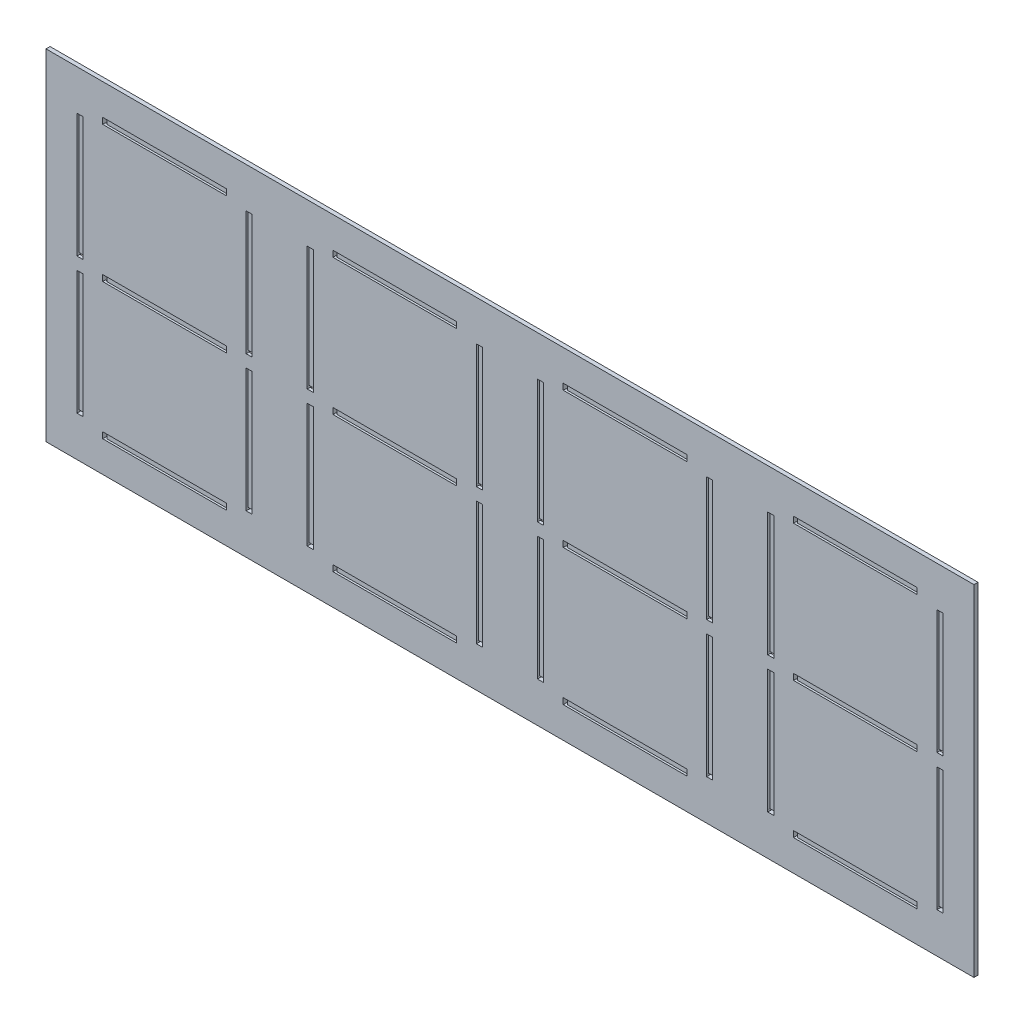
from build123d import *

# Parameters (mm, degrees)
SKETCH2_W           = 2286
SKETCH2_H           = 838.2
BOSS_EXTRUDE1_DEPTH = 10
SKETCH4_W           = 304.8
SKETCH4_H           = 15
SKETCH4_W_2         = 15
SKETCH4_H_2         = 304.8
CUT_EXTRUDE1_DEPTH  = 5
LPATTERN1_COUNT     = 4
LPATTERN1_PITCH     = 567.266666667
SKETCH4_4_W         = 304.8
SKETCH4_4_H         = 15
SKETCH4_4_W_2       = 15
SKETCH4_4_H_2       = 304.8
CUT_EXTRUDE2_DEPTH  = 5
LPATTERN2_COUNT     = 4
LPATTERN2_PITCH     = 567.266582
CUT_EXTRUDE3_START  = -205.994
SKETCH5_W           = 15
SKETCH5_H           = 5
SKETCH5_W_2         = 5
SKETCH5_H_2         = 15
CUT_EXTRUDE3_DEPTH  = 466.598
LPATTERN4_COUNT     = 4
LPATTERN4_PITCH     = 567.266582
CUT_EXTRUDE6_DEPTH  = 3


with BuildPart() as part:
    # Sketch2 → Boss-Extrude1 (new body)
    with BuildSketch(Plane.XY):
        Rectangle(SKETCH2_W, SKETCH2_H)
    extrude(amount=-BOSS_EXTRUDE1_DEPTH)

    # Sketch4 → Cut-Extrude1 (cut)
    with BuildSketch(Plane.XY):
        with Locations((-850.9, 335.4)):
            Rectangle(SKETCH4_W, SKETCH4_H)
        with Locations((-1059.3, 167.64)):
            Rectangle(SKETCH4_W_2, SKETCH4_H_2)
        with Locations((-642.5, 167.64)):
            Rectangle(SKETCH4_W_2, SKETCH4_H_2)
        with Locations((-642.5, -167.64)):
            Rectangle(SKETCH4_W_2, SKETCH4_H_2)
        with Locations((-850.9, -335.4)):
            Rectangle(SKETCH4_W, SKETCH4_H)
        with Locations((-1059.3, -167.64)):
            Rectangle(SKETCH4_W_2, SKETCH4_H_2)
    cut_extrude1 = extrude(amount=-CUT_EXTRUDE1_DEPTH, mode=Mode.SUBTRACT)

    # LPattern1: Cut-Extrude1 ×4
    with Locations(*[(i * LPATTERN1_PITCH, 0, 0) for i in range(1, LPATTERN1_COUNT)]):
        add(cut_extrude1, mode=Mode.SUBTRACT)

    # Sketch4_4 → Cut-Extrude2 (cut)
    with BuildSketch(Plane.XY):
        with Locations((-850.9, 335.4)):
            Rectangle(SKETCH4_4_W, SKETCH4_4_H)
        with Locations((-642.5, -167.64)):
            Rectangle(SKETCH4_4_W_2, SKETCH4_4_H_2)
        with Locations((-1059.3, 167.64)):
            Rectangle(SKETCH4_4_W_2, SKETCH4_4_H_2)
        with Locations((-642.5, 167.64)):
            Rectangle(SKETCH4_4_W_2, SKETCH4_4_H_2)
        with Locations((-1059.3, -167.64)):
            Rectangle(SKETCH4_4_W_2, SKETCH4_4_H_2)
        with Locations((-850.9, -335.4)):
            Rectangle(SKETCH4_4_W, SKETCH4_4_H)
        with Locations((-850.9, 0)):
            Rectangle(SKETCH4_4_W, SKETCH4_4_H)
    cut_extrude2 = extrude(amount=-CUT_EXTRUDE2_DEPTH, mode=Mode.SUBTRACT)

    # LPattern2: Cut-Extrude2 ×4
    with Locations(*[(i * LPATTERN2_PITCH, 0, 0) for i in range(1, LPATTERN2_COUNT)]):
        add(cut_extrude2, mode=Mode.SUBTRACT)

    # Sketch5 → Cut-Extrude3 (cut)
    with BuildSketch(Plane.XY.offset(CUT_EXTRUDE3_START)):
        with Locations((-1059.3, 17.74)):
            Rectangle(SKETCH5_W, SKETCH5_H)
        with Locations((-1000.8, 335.4)):
            Rectangle(SKETCH5_W_2, SKETCH5_H_2)
        with Locations((-642.5, 17.74)):
            Rectangle(SKETCH5_W, SKETCH5_H)
        with Locations((-642.5, -317.54)):
            Rectangle(SKETCH5_W, SKETCH5_H)
        with Locations((-1000.8, -335.4)):
            Rectangle(SKETCH5_W_2, SKETCH5_H_2)
        with Locations((-1059.3, -317.54)):
            Rectangle(SKETCH5_W, SKETCH5_H)
        with Locations((-1000.8, 0)):
            Rectangle(SKETCH5_W_2, SKETCH5_H_2)
    cut_extrude3 = extrude(amount=CUT_EXTRUDE3_DEPTH, mode=Mode.SUBTRACT)

    # LPattern4: Cut-Extrude3 ×4
    with Locations(*[(i * LPATTERN4_PITCH, 0, 0) for i in range(1, LPATTERN4_COUNT)]):
        add(cut_extrude3, mode=Mode.SUBTRACT)

    # Sketch6 → Cut-Extrude6 (cut)
    with BuildSketch(Plane(origin=(0, 0, -10), x_dir=(-1, 0, 0), z_dir=(0, 0, -1))):
        Polygon((-1051.799746, 15.24), (-1066.799746, 15.24), (-1066.799746, -315.04), (-1051.799746, -315.04), (-1051.799746, -226.1), (-713.499746, -226.1), (-713.499746, -342.619381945), (-698.499746, -342.619381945), (-698.499746, -226.1), (-649.999746, -226.1), (-649.999746, -315.04), (-634.999746, -315.04), (-634.999746, -226.1), (-499.533164, -226.1), (-499.533164, -315.04), (-484.533164, -315.04), (-484.533164, -226.1), (-146.233164, -226.1), (-146.233164, -342.865106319), (-131.233164, -342.865106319), (-131.233164, -226.1), (-82.733164, -226.1), (-82.733164, -315.04), (-67.733164, -315.04), (-67.733164, -226.1), (67.733418, -226.1), (67.733418, -315.04), (82.733418, -315.04), (82.733418, -226.1), (421.033418, -226.1), (421.033418, -342.9), (436.033418, -342.9), (436.033418, -226.1), (484.533418, -226.1), (484.533418, -315.04), (499.533418, -315.04), (499.533418, -226.1), (635, -226.1), (635, -315.04), (650, -315.04), (650, -226.1), (988.3, -226.1), (988.3, -342.9), (1003.3, -342.9), (1003.3, -226.1), (1051.8, -226.1), (1051.8, -315.04), (1066.8, -315.04), (1066.8, 15.24), (1051.8, 15.24), (1051.8, -149.9), (1003.3, -149.9), (1003.3, 342.9), (988.3, 342.9), (988.3, -149.9), (650, -149.9), (650, 15.24), (635, 15.24), (635, -149.9), (499.533418, -149.9), (499.533418, 15.24), (484.533418, 15.24), (484.533418, -149.9), (436.033418, -149.9), (436.033418, 342.9), (421.033418, 342.9), (421.033418, -149.9), (82.733418, -149.9), (82.733418, 15.24), (67.733418, 15.24), (67.733418, -149.9), (-67.733164, -149.9), (-67.733164, 15.24), (-82.733164, 15.24), (-82.733164, -149.9), (-131.233164, -149.9), (-131.233164, 342.9), (-146.233164, 342.9), (-146.233164, -149.9), (-484.533164, -149.9), (-484.533164, 15.24), (-499.533164, 15.24), (-499.533164, -149.9), (-634.999746, -149.9), (-634.999746, 15.24), (-649.999746, 15.24), (-649.999746, -149.9), (-698.499746, -149.9), (-698.499746, 342.9), (-713.499746, 342.9), (-713.499746, -149.9), (-1051.799746, -149.9), align=None)
    extrude(amount=-CUT_EXTRUDE6_DEPTH, mode=Mode.SUBTRACT)


solid = part.part
